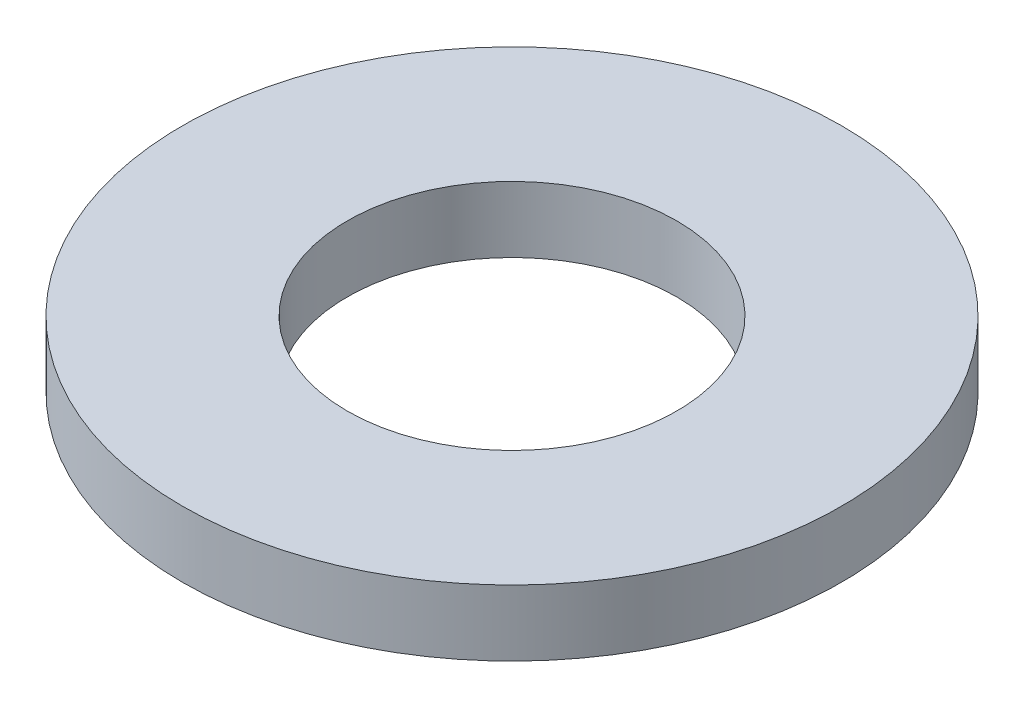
ISO-10303-21;
HEADER;
FILE_DESCRIPTION(('STEP AP214'),'2;1');
FILE_NAME('part.step','',(''),(''),'','','');
FILE_SCHEMA(('AUTOMOTIVE_DESIGN { 1 0 10303 214 1 1 1 1 }'));
ENDSEC;
DATA;
#1=APPLICATION_CONTEXT('core data for automotive mechanical design processes');
#2=APPLICATION_PROTOCOL_DEFINITION('international standard','automotive_design',2000,#1);
#3=PRODUCT_CONTEXT('',#1,'mechanical');
#4=PRODUCT('Part','Part','',(#3));
#5=PRODUCT_RELATED_PRODUCT_CATEGORY('part','',(#4));
#6=PRODUCT_DEFINITION_FORMATION('','',#4);
#7=PRODUCT_DEFINITION_CONTEXT('part definition',#1,'design');
#8=PRODUCT_DEFINITION('design','',#6,#7);
#9=PRODUCT_DEFINITION_SHAPE('','',#8);
#10=(LENGTH_UNIT() NAMED_UNIT(*) SI_UNIT(.MILLI.,.METRE.));
#11=(NAMED_UNIT(*) PLANE_ANGLE_UNIT() SI_UNIT($,.RADIAN.));
#12=(NAMED_UNIT(*) SI_UNIT($,.STERADIAN.) SOLID_ANGLE_UNIT());
#13=UNCERTAINTY_MEASURE_WITH_UNIT(LENGTH_MEASURE(1.E-05),#10,'distance_accuracy_value','');
#14=(GEOMETRIC_REPRESENTATION_CONTEXT(3) GLOBAL_UNCERTAINTY_ASSIGNED_CONTEXT((#13)) GLOBAL_UNIT_ASSIGNED_CONTEXT((#10,
#11,#12)) REPRESENTATION_CONTEXT('',''));
#15=CARTESIAN_POINT('',(0.,0.,0.));
#16=DIRECTION('',(0.,0.,1.));
#17=DIRECTION('',(1.,0.,0.));
#18=AXIS2_PLACEMENT_3D('',#15,#16,#17);
#19=CARTESIAN_POINT('',(0.,1.27,0.));
#20=DIRECTION('',(0.,1.,0.));
#21=DIRECTION('',(0.,0.,1.));
#22=AXIS2_PLACEMENT_3D('',#19,#20,#21);
#23=PLANE('',#22);
#24=CARTESIAN_POINT('',(0.,1.27,0.));
#25=DIRECTION('',(0.,1.,0.));
#26=DIRECTION('',(0.,0.,1.));
#27=AXIS2_PLACEMENT_3D('',#24,#25,#26);
#28=CIRCLE('',#27,6.35);
#29=CARTESIAN_POINT('',(0.,1.27,6.35));
#30=VERTEX_POINT('',#29);
#31=EDGE_CURVE('E10',#30,#30,#28,.T.);
#32=ORIENTED_EDGE('',*,*,#31,.T.);
#33=EDGE_LOOP('',(#32));
#34=FACE_BOUND('',#33,.T.);
#35=CARTESIAN_POINT('',(0.,1.27,0.));
#36=DIRECTION('',(0.,1.,0.));
#37=DIRECTION('',(0.,0.,1.));
#38=AXIS2_PLACEMENT_3D('',#35,#36,#37);
#39=CIRCLE('',#38,3.175);
#40=CARTESIAN_POINT('',(0.,1.27,3.175));
#41=VERTEX_POINT('',#40);
#42=EDGE_CURVE('E50',#41,#41,#39,.T.);
#43=ORIENTED_EDGE('',*,*,#42,.F.);
#44=EDGE_LOOP('',(#43));
#45=FACE_BOUND('',#44,.T.);
#46=ADVANCED_FACE('F37',(#34,#45),#23,.T.);
#47=CARTESIAN_POINT('',(0.,0.,0.));
#48=DIRECTION('',(0.,1.,0.));
#49=DIRECTION('',(0.,0.,1.));
#50=AXIS2_PLACEMENT_3D('',#47,#48,#49);
#51=PLANE('',#50);
#52=CARTESIAN_POINT('',(0.,0.,0.));
#53=DIRECTION('',(0.,1.,0.));
#54=DIRECTION('',(0.,0.,1.));
#55=AXIS2_PLACEMENT_3D('',#52,#53,#54);
#56=CIRCLE('',#55,6.35);
#57=CARTESIAN_POINT('',(0.,0.,6.35));
#58=VERTEX_POINT('',#57);
#59=EDGE_CURVE('E41',#58,#58,#56,.T.);
#60=ORIENTED_EDGE('',*,*,#59,.F.);
#61=EDGE_LOOP('',(#60));
#62=FACE_BOUND('',#61,.T.);
#63=CARTESIAN_POINT('',(0.,0.,0.));
#64=DIRECTION('',(0.,1.,0.));
#65=DIRECTION('',(0.,0.,1.));
#66=AXIS2_PLACEMENT_3D('',#63,#64,#65);
#67=CIRCLE('',#66,3.175);
#68=CARTESIAN_POINT('',(0.,0.,3.175));
#69=VERTEX_POINT('',#68);
#70=EDGE_CURVE('E52',#69,#69,#67,.T.);
#71=ORIENTED_EDGE('',*,*,#70,.T.);
#72=EDGE_LOOP('',(#71));
#73=FACE_BOUND('',#72,.T.);
#74=ADVANCED_FACE('F64',(#62,#73),#51,.F.);
#75=CARTESIAN_POINT('',(0.,1.27,0.));
#76=DIRECTION('',(0.,-1.,0.));
#77=DIRECTION('',(0.,0.,-1.));
#78=AXIS2_PLACEMENT_3D('',#75,#76,#77);
#79=CYLINDRICAL_SURFACE('',#78,6.35);
#80=ORIENTED_EDGE('',*,*,#31,.F.);
#81=EDGE_LOOP('',(#80));
#82=FACE_BOUND('',#81,.T.);
#83=ORIENTED_EDGE('',*,*,#59,.T.);
#84=EDGE_LOOP('',(#83));
#85=FACE_BOUND('',#84,.T.);
#86=ADVANCED_FACE('F39',(#82,#85),#79,.T.);
#87=CARTESIAN_POINT('',(0.,1.27,0.));
#88=DIRECTION('',(0.,-1.,0.));
#89=DIRECTION('',(0.,0.,-1.));
#90=AXIS2_PLACEMENT_3D('',#87,#88,#89);
#91=CYLINDRICAL_SURFACE('',#90,3.175);
#92=ORIENTED_EDGE('',*,*,#42,.T.);
#93=EDGE_LOOP('',(#92));
#94=FACE_BOUND('',#93,.T.);
#95=ORIENTED_EDGE('',*,*,#70,.F.);
#96=EDGE_LOOP('',(#95));
#97=FACE_BOUND('',#96,.T.);
#98=ADVANCED_FACE('F60',(#94,#97),#91,.F.);
#99=CLOSED_SHELL('',(#46,#74,#86,#98));
#100=MANIFOLD_SOLID_BREP('B2',#99);
#101=ADVANCED_BREP_SHAPE_REPRESENTATION('',(#18,#100),#14);
#102=SHAPE_DEFINITION_REPRESENTATION(#9,#101);
ENDSEC;
END-ISO-10303-21;
